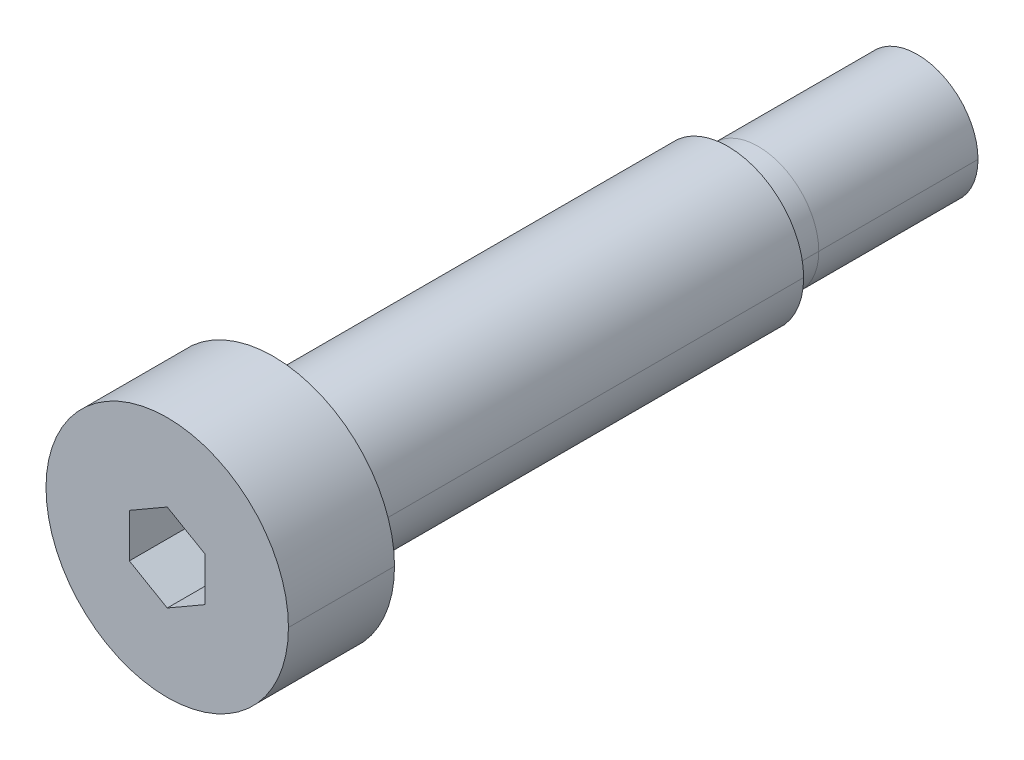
ISO-10303-21;
HEADER;
FILE_DESCRIPTION(('STEP AP214'),'2;1');
FILE_NAME('part.step','',(''),(''),'','','');
FILE_SCHEMA(('AUTOMOTIVE_DESIGN { 1 0 10303 214 1 1 1 1 }'));
ENDSEC;
DATA;
#1=APPLICATION_CONTEXT('core data for automotive mechanical design processes');
#2=APPLICATION_PROTOCOL_DEFINITION('international standard','automotive_design',2000,#1);
#3=PRODUCT_CONTEXT('',#1,'mechanical');
#4=PRODUCT('Part','Part','',(#3));
#5=PRODUCT_RELATED_PRODUCT_CATEGORY('part','',(#4));
#6=PRODUCT_DEFINITION_FORMATION('','',#4);
#7=PRODUCT_DEFINITION_CONTEXT('part definition',#1,'design');
#8=PRODUCT_DEFINITION('design','',#6,#7);
#9=PRODUCT_DEFINITION_SHAPE('','',#8);
#10=(LENGTH_UNIT() NAMED_UNIT(*) SI_UNIT(.MILLI.,.METRE.));
#11=(NAMED_UNIT(*) PLANE_ANGLE_UNIT() SI_UNIT($,.RADIAN.));
#12=(NAMED_UNIT(*) SI_UNIT($,.STERADIAN.) SOLID_ANGLE_UNIT());
#13=UNCERTAINTY_MEASURE_WITH_UNIT(LENGTH_MEASURE(1.E-05),#10,'distance_accuracy_value','');
#14=(GEOMETRIC_REPRESENTATION_CONTEXT(3) GLOBAL_UNCERTAINTY_ASSIGNED_CONTEXT((#13)) GLOBAL_UNIT_ASSIGNED_CONTEXT((#10,
#11,#12)) REPRESENTATION_CONTEXT('',''));
#15=CARTESIAN_POINT('',(0.,0.,0.));
#16=DIRECTION('',(0.,0.,1.));
#17=DIRECTION('',(1.,0.,0.));
#18=AXIS2_PLACEMENT_3D('',#15,#16,#17);
#19=CARTESIAN_POINT('',(0.,0.,-9.));
#20=DIRECTION('',(0.,0.,1.));
#21=DIRECTION('',(1.,0.,0.));
#22=AXIS2_PLACEMENT_3D('',#19,#20,#21);
#23=CYLINDRICAL_SURFACE('',#22,4.);
#24=CARTESIAN_POINT('',(0.,0.,-42.5063536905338));
#25=DIRECTION('',(0.,0.,1.));
#26=DIRECTION('',(1.,0.,0.));
#27=AXIS2_PLACEMENT_3D('',#24,#25,#26);
#28=CIRCLE('',#27,4.);
#29=CARTESIAN_POINT('',(4.,0.,-42.5063536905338));
#30=VERTEX_POINT('',#29);
#31=CARTESIAN_POINT('',(-4.,0.,-42.5063536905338));
#32=VERTEX_POINT('',#31);
#33=EDGE_CURVE('P0_E11',#30,#32,#28,.T.);
#34=ORIENTED_EDGE('',*,*,#33,.T.);
#35=DIRECTION('',(0.,0.,1.));
#36=VECTOR('',#35,1.);
#37=CARTESIAN_POINT('',(-4.,0.,-9.));
#38=LINE('',#37,#36);
#39=CARTESIAN_POINT('',(-4.,0.,-32.));
#40=VERTEX_POINT('',#39);
#41=EDGE_CURVE('P0_E28',#32,#40,#38,.T.);
#42=ORIENTED_EDGE('',*,*,#41,.T.);
#43=CARTESIAN_POINT('',(0.,0.,-32.));
#44=DIRECTION('',(0.,0.,1.));
#45=DIRECTION('',(1.,0.,0.));
#46=AXIS2_PLACEMENT_3D('',#43,#44,#45);
#47=CIRCLE('',#46,4.);
#48=CARTESIAN_POINT('',(4.,0.,-32.));
#49=VERTEX_POINT('',#48);
#50=EDGE_CURVE('P0_E98',#49,#40,#47,.T.);
#51=ORIENTED_EDGE('',*,*,#50,.F.);
#52=DIRECTION('',(0.,0.,1.));
#53=VECTOR('',#52,1.);
#54=CARTESIAN_POINT('',(4.,0.,-9.));
#55=LINE('',#54,#53);
#56=EDGE_CURVE('P0_E127',#30,#49,#55,.T.);
#57=ORIENTED_EDGE('',*,*,#56,.F.);
#58=EDGE_LOOP('',(#34,#42,#51,#57));
#59=FACE_BOUND('',#58,.T.);
#60=ADVANCED_FACE('P0_F17',(#59),#23,.T.);
#61=CARTESIAN_POINT('',(0.,0.,-9.));
#62=DIRECTION('',(0.,0.,1.));
#63=DIRECTION('',(1.,0.,0.));
#64=AXIS2_PLACEMENT_3D('',#61,#62,#63);
#65=CYLINDRICAL_SURFACE('',#64,3.295);
#66=CARTESIAN_POINT('',(0.,0.,-43.));
#67=DIRECTION('',(0.,0.,1.));
#68=DIRECTION('',(1.,0.,0.));
#69=AXIS2_PLACEMENT_3D('',#66,#67,#68);
#70=CIRCLE('',#69,3.295);
#71=CARTESIAN_POINT('',(-3.295,0.,-43.));
#72=VERTEX_POINT('',#71);
#73=CARTESIAN_POINT('',(3.295,0.,-43.));
#74=VERTEX_POINT('',#73);
#75=EDGE_CURVE('P0_E93',#72,#74,#70,.T.);
#76=ORIENTED_EDGE('',*,*,#75,.F.);
#77=DIRECTION('',(0.,0.,1.));
#78=VECTOR('',#77,1.);
#79=CARTESIAN_POINT('',(-3.295,0.,-9.));
#80=LINE('',#79,#78);
#81=CARTESIAN_POINT('',(-3.295,0.,-32.));
#82=VERTEX_POINT('',#81);
#83=EDGE_CURVE('P0_E88',#72,#82,#80,.T.);
#84=ORIENTED_EDGE('',*,*,#83,.T.);
#85=CARTESIAN_POINT('',(0.,0.,-32.));
#86=DIRECTION('',(0.,0.,1.));
#87=DIRECTION('',(1.,0.,0.));
#88=AXIS2_PLACEMENT_3D('',#85,#86,#87);
#89=CIRCLE('',#88,3.295);
#90=CARTESIAN_POINT('',(3.295,0.,-32.));
#91=VERTEX_POINT('',#90);
#92=EDGE_CURVE('P0_E84',#82,#91,#89,.T.);
#93=ORIENTED_EDGE('',*,*,#92,.T.);
#94=DIRECTION('',(0.,0.,1.));
#95=VECTOR('',#94,1.);
#96=CARTESIAN_POINT('',(3.295,0.,-9.));
#97=LINE('',#96,#95);
#98=EDGE_CURVE('P0_E70',#74,#91,#97,.T.);
#99=ORIENTED_EDGE('',*,*,#98,.F.);
#100=EDGE_LOOP('',(#76,#84,#93,#99));
#101=FACE_BOUND('',#100,.T.);
#102=ADVANCED_FACE('P0_F92',(#101),#65,.F.);
#103=CARTESIAN_POINT('',(0.,0.,-42.5063536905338));
#104=DIRECTION('',(0.,0.,1.));
#105=DIRECTION('',(1.,0.,0.));
#106=AXIS2_PLACEMENT_3D('',#103,#104,#105);
#107=CONICAL_SURFACE('',#106,4.,0.959931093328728);
#108=CARTESIAN_POINT('',(0.,0.,-43.));
#109=DIRECTION('',(0.,0.,1.));
#110=DIRECTION('',(1.,0.,0.));
#111=AXIS2_PLACEMENT_3D('',#108,#109,#110);
#112=CIRCLE('',#111,3.295);
#113=EDGE_CURVE('P0_E89',#74,#72,#112,.T.);
#114=ORIENTED_EDGE('',*,*,#113,.T.);
#115=DIRECTION('',(-0.819152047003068,0.,0.573576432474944));
#116=VECTOR('',#115,1.);
#117=CARTESIAN_POINT('',(-4.,0.,-42.5063536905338));
#118=LINE('',#117,#116);
#119=EDGE_CURVE('P0_E43',#72,#32,#118,.T.);
#120=ORIENTED_EDGE('',*,*,#119,.T.);
#121=ORIENTED_EDGE('',*,*,#33,.F.);
#122=DIRECTION('',(0.819152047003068,0.,0.573576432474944));
#123=VECTOR('',#122,1.);
#124=CARTESIAN_POINT('',(4.,0.,-42.5063536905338));
#125=LINE('',#124,#123);
#126=EDGE_CURVE('P0_E105',#74,#30,#125,.T.);
#127=ORIENTED_EDGE('',*,*,#126,.F.);
#128=EDGE_LOOP('',(#114,#120,#121,#127));
#129=FACE_BOUND('',#128,.T.);
#130=ADVANCED_FACE('P0_F143',(#129),#107,.T.);
#131=CARTESIAN_POINT('',(0.,0.,-42.5063536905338));
#132=DIRECTION('',(0.,0.,1.));
#133=DIRECTION('',(1.,0.,0.));
#134=AXIS2_PLACEMENT_3D('',#131,#132,#133);
#135=CONICAL_SURFACE('',#134,4.,0.959931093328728);
#136=ORIENTED_EDGE('',*,*,#119,.F.);
#137=ORIENTED_EDGE('',*,*,#75,.T.);
#138=ORIENTED_EDGE('',*,*,#126,.T.);
#139=CARTESIAN_POINT('',(0.,0.,-42.5063536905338));
#140=DIRECTION('',(0.,0.,1.));
#141=DIRECTION('',(1.,0.,0.));
#142=AXIS2_PLACEMENT_3D('',#139,#140,#141);
#143=CIRCLE('',#142,4.);
#144=EDGE_CURVE('P0_E21',#32,#30,#143,.T.);
#145=ORIENTED_EDGE('',*,*,#144,.F.);
#146=EDGE_LOOP('',(#136,#137,#138,#145));
#147=FACE_BOUND('',#146,.T.);
#148=ADVANCED_FACE('P0_F141',(#147),#135,.T.);
#149=CARTESIAN_POINT('',(0.,0.,-9.));
#150=DIRECTION('',(0.,0.,1.));
#151=DIRECTION('',(1.,0.,0.));
#152=AXIS2_PLACEMENT_3D('',#149,#150,#151);
#153=CYLINDRICAL_SURFACE('',#152,3.295);
#154=ORIENTED_EDGE('',*,*,#83,.F.);
#155=ORIENTED_EDGE('',*,*,#113,.F.);
#156=ORIENTED_EDGE('',*,*,#98,.T.);
#157=CARTESIAN_POINT('',(0.,0.,-32.));
#158=DIRECTION('',(0.,0.,1.));
#159=DIRECTION('',(1.,0.,0.));
#160=AXIS2_PLACEMENT_3D('',#157,#158,#159);
#161=CIRCLE('',#160,3.295);
#162=EDGE_CURVE('P0_E86',#91,#82,#161,.T.);
#163=ORIENTED_EDGE('',*,*,#162,.T.);
#164=EDGE_LOOP('',(#154,#155,#156,#163));
#165=FACE_BOUND('',#164,.T.);
#166=ADVANCED_FACE('P0_F96',(#165),#153,.F.);
#167=CARTESIAN_POINT('',(0.,3.295,-32.));
#168=DIRECTION('',(0.,0.,1.));
#169=DIRECTION('',(1.,0.,0.));
#170=AXIS2_PLACEMENT_3D('',#167,#168,#169);
#171=PLANE('',#170);
#172=ORIENTED_EDGE('',*,*,#50,.T.);
#173=CARTESIAN_POINT('',(0.,0.,-32.));
#174=DIRECTION('',(0.,0.,1.));
#175=DIRECTION('',(1.,0.,0.));
#176=AXIS2_PLACEMENT_3D('',#173,#174,#175);
#177=CIRCLE('',#176,4.);
#178=EDGE_CURVE('P0_E107',#40,#49,#177,.T.);
#179=ORIENTED_EDGE('',*,*,#178,.T.);
#180=EDGE_LOOP('',(#172,#179));
#181=FACE_BOUND('',#180,.T.);
#182=ORIENTED_EDGE('',*,*,#162,.F.);
#183=ORIENTED_EDGE('',*,*,#92,.F.);
#184=EDGE_LOOP('',(#182,#183));
#185=FACE_BOUND('',#184,.T.);
#186=ADVANCED_FACE('P0_F19',(#181,#185),#171,.T.);
#187=CARTESIAN_POINT('',(0.,0.,-9.));
#188=DIRECTION('',(0.,0.,1.));
#189=DIRECTION('',(1.,0.,0.));
#190=AXIS2_PLACEMENT_3D('',#187,#188,#189);
#191=CYLINDRICAL_SURFACE('',#190,4.);
#192=ORIENTED_EDGE('',*,*,#41,.F.);
#193=ORIENTED_EDGE('',*,*,#144,.T.);
#194=ORIENTED_EDGE('',*,*,#56,.T.);
#195=ORIENTED_EDGE('',*,*,#178,.F.);
#196=EDGE_LOOP('',(#192,#193,#194,#195));
#197=FACE_BOUND('',#196,.T.);
#198=ADVANCED_FACE('P0_F139',(#197),#191,.T.);
#199=CLOSED_SHELL('',(#60,#102,#130,#148,#166,#186,#198));
#200=MANIFOLD_SOLID_BREP('P0_B1',#199);
#201=CARTESIAN_POINT('',(0.,0.,-43.));
#202=DIRECTION('',(0.,0.,-1.));
#203=DIRECTION('',(-1.,0.,0.));
#204=AXIS2_PLACEMENT_3D('',#201,#202,#203);
#205=CYLINDRICAL_SURFACE('',#204,3.295);
#206=CARTESIAN_POINT('',(0.,0.,-32.));
#207=DIRECTION('',(0.,0.,-1.));
#208=DIRECTION('',(-1.,0.,0.));
#209=AXIS2_PLACEMENT_3D('',#206,#207,#208);
#210=CIRCLE('',#209,3.295);
#211=CARTESIAN_POINT('',(-3.295,0.,-32.));
#212=VERTEX_POINT('',#211);
#213=CARTESIAN_POINT('',(3.295,0.,-32.));
#214=VERTEX_POINT('',#213);
#215=EDGE_CURVE('P1_E11',#212,#214,#210,.T.);
#216=ORIENTED_EDGE('',*,*,#215,.T.);
#217=DIRECTION('',(0.,0.,-1.));
#218=VECTOR('',#217,1.);
#219=CARTESIAN_POINT('',(3.295,0.,-43.));
#220=LINE('',#219,#218);
#221=CARTESIAN_POINT('',(3.295,0.,-43.));
#222=VERTEX_POINT('',#221);
#223=EDGE_CURVE('P1_E28',#214,#222,#220,.T.);
#224=ORIENTED_EDGE('',*,*,#223,.T.);
#225=CARTESIAN_POINT('',(0.,0.,-43.));
#226=DIRECTION('',(0.,0.,-1.));
#227=DIRECTION('',(-1.,0.,0.));
#228=AXIS2_PLACEMENT_3D('',#225,#226,#227);
#229=CIRCLE('',#228,3.295);
#230=CARTESIAN_POINT('',(-3.295,0.,-43.));
#231=VERTEX_POINT('',#230);
#232=EDGE_CURVE('P1_E271',#231,#222,#229,.T.);
#233=ORIENTED_EDGE('',*,*,#232,.F.);
#234=DIRECTION('',(0.,0.,-1.));
#235=VECTOR('',#234,1.);
#236=CARTESIAN_POINT('',(-3.295,0.,-43.));
#237=LINE('',#236,#235);
#238=EDGE_CURVE('P1_E295',#212,#231,#237,.T.);
#239=ORIENTED_EDGE('',*,*,#238,.F.);
#240=EDGE_LOOP('',(#216,#224,#233,#239));
#241=FACE_BOUND('',#240,.T.);
#242=ADVANCED_FACE('P1_F17',(#241),#205,.T.);
#243=CARTESIAN_POINT('',(0.,0.,-43.));
#244=DIRECTION('',(0.,0.,-1.));
#245=DIRECTION('',(-1.,0.,0.));
#246=AXIS2_PLACEMENT_3D('',#243,#244,#245);
#247=CYLINDRICAL_SURFACE('',#246,8.);
#248=CARTESIAN_POINT('',(0.,0.,7.));
#249=DIRECTION('',(0.,0.,-1.));
#250=DIRECTION('',(-1.,0.,0.));
#251=AXIS2_PLACEMENT_3D('',#248,#249,#250);
#252=CIRCLE('',#251,8.);
#253=CARTESIAN_POINT('',(-8.,0.,7.));
#254=VERTEX_POINT('',#253);
#255=CARTESIAN_POINT('',(8.,0.,7.));
#256=VERTEX_POINT('',#255);
#257=EDGE_CURVE('P1_E220',#254,#256,#252,.T.);
#258=ORIENTED_EDGE('',*,*,#257,.T.);
#259=DIRECTION('',(0.,0.,-1.));
#260=VECTOR('',#259,1.);
#261=CARTESIAN_POINT('',(8.,0.,-43.));
#262=LINE('',#261,#260);
#263=CARTESIAN_POINT('',(8.,0.,0.));
#264=VERTEX_POINT('',#263);
#265=EDGE_CURVE('P1_E21',#256,#264,#262,.T.);
#266=ORIENTED_EDGE('',*,*,#265,.T.);
#267=CARTESIAN_POINT('',(0.,0.,0.));
#268=DIRECTION('',(0.,0.,-1.));
#269=DIRECTION('',(-1.,0.,0.));
#270=AXIS2_PLACEMENT_3D('',#267,#268,#269);
#271=CIRCLE('',#270,8.);
#272=CARTESIAN_POINT('',(-8.,0.,0.));
#273=VERTEX_POINT('',#272);
#274=EDGE_CURVE('P1_E234',#273,#264,#271,.T.);
#275=ORIENTED_EDGE('',*,*,#274,.F.);
#276=DIRECTION('',(0.,0.,-1.));
#277=VECTOR('',#276,1.);
#278=CARTESIAN_POINT('',(-8.,0.,-43.));
#279=LINE('',#278,#277);
#280=EDGE_CURVE('P1_E270',#254,#273,#279,.T.);
#281=ORIENTED_EDGE('',*,*,#280,.F.);
#282=EDGE_LOOP('',(#258,#266,#275,#281));
#283=FACE_BOUND('',#282,.T.);
#284=ADVANCED_FACE('P1_F319',(#283),#247,.T.);
#285=CARTESIAN_POINT('',(0.,0.,-43.));
#286=DIRECTION('',(0.,0.,-1.));
#287=DIRECTION('',(-1.,0.,0.));
#288=AXIS2_PLACEMENT_3D('',#285,#286,#287);
#289=CYLINDRICAL_SURFACE('',#288,5.);
#290=CARTESIAN_POINT('',(0.,0.,0.));
#291=DIRECTION('',(0.,0.,-1.));
#292=DIRECTION('',(-1.,0.,0.));
#293=AXIS2_PLACEMENT_3D('',#290,#291,#292);
#294=CIRCLE('',#293,5.);
#295=CARTESIAN_POINT('',(-5.,0.,0.));
#296=VERTEX_POINT('',#295);
#297=CARTESIAN_POINT('',(5.,0.,0.));
#298=VERTEX_POINT('',#297);
#299=EDGE_CURVE('P1_E224',#296,#298,#294,.T.);
#300=ORIENTED_EDGE('',*,*,#299,.T.);
#301=DIRECTION('',(0.,0.,-1.));
#302=VECTOR('',#301,1.);
#303=CARTESIAN_POINT('',(5.,0.,-43.));
#304=LINE('',#303,#302);
#305=CARTESIAN_POINT('',(5.,0.,-30.));
#306=VERTEX_POINT('',#305);
#307=EDGE_CURVE('P1_E227',#298,#306,#304,.T.);
#308=ORIENTED_EDGE('',*,*,#307,.T.);
#309=CARTESIAN_POINT('',(0.,0.,-30.));
#310=DIRECTION('',(0.,0.,-1.));
#311=DIRECTION('',(-1.,0.,0.));
#312=AXIS2_PLACEMENT_3D('',#309,#310,#311);
#313=CIRCLE('',#312,5.);
#314=CARTESIAN_POINT('',(-5.,0.,-30.));
#315=VERTEX_POINT('',#314);
#316=EDGE_CURVE('P1_E219',#315,#306,#313,.T.);
#317=ORIENTED_EDGE('',*,*,#316,.F.);
#318=DIRECTION('',(0.,0.,-1.));
#319=VECTOR('',#318,1.);
#320=CARTESIAN_POINT('',(-5.,0.,-43.));
#321=LINE('',#320,#319);
#322=EDGE_CURVE('P1_E83',#296,#315,#321,.T.);
#323=ORIENTED_EDGE('',*,*,#322,.F.);
#324=EDGE_LOOP('',(#300,#308,#317,#323));
#325=FACE_BOUND('',#324,.T.);
#326=ADVANCED_FACE('P1_F382',(#325),#289,.T.);
#327=CARTESIAN_POINT('',(0.,0.,-43.));
#328=DIRECTION('',(0.,0.,-1.));
#329=DIRECTION('',(-1.,0.,0.));
#330=AXIS2_PLACEMENT_3D('',#327,#328,#329);
#331=CYLINDRICAL_SURFACE('',#330,4.);
#332=CARTESIAN_POINT('',(0.,0.,-30.));
#333=DIRECTION('',(0.,0.,-1.));
#334=DIRECTION('',(-1.,0.,0.));
#335=AXIS2_PLACEMENT_3D('',#332,#333,#334);
#336=CIRCLE('',#335,4.);
#337=CARTESIAN_POINT('',(-4.,0.,-30.));
#338=VERTEX_POINT('',#337);
#339=CARTESIAN_POINT('',(4.,0.,-30.));
#340=VERTEX_POINT('',#339);
#341=EDGE_CURVE('P1_E253',#338,#340,#336,.T.);
#342=ORIENTED_EDGE('',*,*,#341,.T.);
#343=DIRECTION('',(0.,0.,-1.));
#344=VECTOR('',#343,1.);
#345=CARTESIAN_POINT('',(4.,0.,-43.));
#346=LINE('',#345,#344);
#347=CARTESIAN_POINT('',(4.,0.,-32.));
#348=VERTEX_POINT('',#347);
#349=EDGE_CURVE('P1_E98',#340,#348,#346,.T.);
#350=ORIENTED_EDGE('',*,*,#349,.T.);
#351=CARTESIAN_POINT('',(0.,0.,-32.));
#352=DIRECTION('',(0.,0.,-1.));
#353=DIRECTION('',(-1.,0.,0.));
#354=AXIS2_PLACEMENT_3D('',#351,#352,#353);
#355=CIRCLE('',#354,4.);
#356=CARTESIAN_POINT('',(-4.,0.,-32.));
#357=VERTEX_POINT('',#356);
#358=EDGE_CURVE('P1_E254',#357,#348,#355,.T.);
#359=ORIENTED_EDGE('',*,*,#358,.F.);
#360=DIRECTION('',(0.,0.,-1.));
#361=VECTOR('',#360,1.);
#362=CARTESIAN_POINT('',(-4.,0.,-43.));
#363=LINE('',#362,#361);
#364=EDGE_CURVE('P1_E237',#338,#357,#363,.T.);
#365=ORIENTED_EDGE('',*,*,#364,.F.);
#366=EDGE_LOOP('',(#342,#350,#359,#365));
#367=FACE_BOUND('',#366,.T.);
#368=ADVANCED_FACE('P1_F389',(#367),#331,.T.);
#369=CARTESIAN_POINT('',(0.,0.,7.));
#370=DIRECTION('',(0.,0.,-1.));
#371=DIRECTION('',(0.,-1.,0.));
#372=AXIS2_PLACEMENT_3D('',#369,#370,#371);
#373=PLANE('',#372);
#374=ORIENTED_EDGE('',*,*,#257,.F.);
#375=CARTESIAN_POINT('',(0.,0.,7.));
#376=DIRECTION('',(0.,0.,-1.));
#377=DIRECTION('',(-1.,0.,0.));
#378=AXIS2_PLACEMENT_3D('',#375,#376,#377);
#379=CIRCLE('',#378,8.);
#380=EDGE_CURVE('P1_E235',#256,#254,#379,.T.);
#381=ORIENTED_EDGE('',*,*,#380,.F.);
#382=EDGE_LOOP('',(#374,#381));
#383=FACE_BOUND('',#382,.T.);
#384=DIRECTION('',(-0.866025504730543,-0.499999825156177,0.));
#385=VECTOR('',#384,1.);
#386=CARTESIAN_POINT('',(-1.24999912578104,2.16506300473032,7.));
#387=LINE('',#386,#385);
#388=CARTESIAN_POINT('',(0.,2.88675,7.));
#389=VERTEX_POINT('',#388);
#390=CARTESIAN_POINT('',(-2.5,1.443375,7.));
#391=VERTEX_POINT('',#390);
#392=EDGE_CURVE('P1_E260',#389,#391,#387,.T.);
#393=ORIENTED_EDGE('',*,*,#392,.F.);
#394=DIRECTION('',(-0.866025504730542,0.499999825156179,0.));
#395=VECTOR('',#394,1.);
#396=CARTESIAN_POINT('',(1.24999912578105,2.16506300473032,7.));
#397=LINE('',#396,#395);
#398=CARTESIAN_POINT('',(2.5,1.443375,7.));
#399=VERTEX_POINT('',#398);
#400=EDGE_CURVE('P1_E202',#399,#389,#397,.T.);
#401=ORIENTED_EDGE('',*,*,#400,.F.);
#402=DIRECTION('',(0.,1.,0.));
#403=VECTOR('',#402,1.);
#404=CARTESIAN_POINT('',(2.5,0.,7.));
#405=LINE('',#404,#403);
#406=CARTESIAN_POINT('',(2.5,-1.443375,7.));
#407=VERTEX_POINT('',#406);
#408=EDGE_CURVE('P1_E188',#407,#399,#405,.T.);
#409=ORIENTED_EDGE('',*,*,#408,.F.);
#410=DIRECTION('',(0.866025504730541,0.499999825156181,0.));
#411=VECTOR('',#410,1.);
#412=CARTESIAN_POINT('',(1.24999912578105,-2.16506300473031,7.));
#413=LINE('',#412,#411);
#414=CARTESIAN_POINT('',(0.,-2.88675,7.));
#415=VERTEX_POINT('',#414);
#416=EDGE_CURVE('P1_E215',#415,#407,#413,.T.);
#417=ORIENTED_EDGE('',*,*,#416,.F.);
#418=DIRECTION('',(0.866025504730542,-0.499999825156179,0.));
#419=VECTOR('',#418,1.);
#420=CARTESIAN_POINT('',(-1.24999912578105,-2.16506300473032,7.));
#421=LINE('',#420,#419);
#422=CARTESIAN_POINT('',(-2.4999982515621,-1.44337600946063,7.));
#423=VERTEX_POINT('',#422);
#424=EDGE_CURVE('P1_E282',#423,#415,#421,.T.);
#425=ORIENTED_EDGE('',*,*,#424,.F.);
#426=DIRECTION('',(6.0567672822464E-07,-0.999999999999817,0.));
#427=VECTOR('',#426,1.);
#428=CARTESIAN_POINT('',(-2.49999912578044,-1.51419129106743E-06,7.));
#429=LINE('',#428,#427);
#430=EDGE_CURVE('P1_E249',#391,#423,#429,.T.);
#431=ORIENTED_EDGE('',*,*,#430,.F.);
#432=EDGE_LOOP('',(#393,#401,#409,#417,#425,#431));
#433=FACE_BOUND('',#432,.T.);
#434=ADVANCED_FACE('P1_F290',(#383,#433),#373,.F.);
#435=CARTESIAN_POINT('',(4.,0.,-32.));
#436=DIRECTION('',(0.,0.,1.));
#437=DIRECTION('',(1.,0.,0.));
#438=AXIS2_PLACEMENT_3D('',#435,#436,#437);
#439=PLANE('',#438);
#440=ORIENTED_EDGE('',*,*,#358,.T.);
#441=CARTESIAN_POINT('',(0.,0.,-32.));
#442=DIRECTION('',(0.,0.,-1.));
#443=DIRECTION('',(-1.,0.,0.));
#444=AXIS2_PLACEMENT_3D('',#441,#442,#443);
#445=CIRCLE('',#444,4.);
#446=EDGE_CURVE('P1_E263',#348,#357,#445,.T.);
#447=ORIENTED_EDGE('',*,*,#446,.T.);
#448=EDGE_LOOP('',(#440,#447));
#449=FACE_BOUND('',#448,.T.);
#450=ORIENTED_EDGE('',*,*,#215,.F.);
#451=CARTESIAN_POINT('',(0.,0.,-32.));
#452=DIRECTION('',(0.,0.,-1.));
#453=DIRECTION('',(-1.,0.,0.));
#454=AXIS2_PLACEMENT_3D('',#451,#452,#453);
#455=CIRCLE('',#454,3.295);
#456=EDGE_CURVE('P1_E344',#214,#212,#455,.T.);
#457=ORIENTED_EDGE('',*,*,#456,.F.);
#458=EDGE_LOOP('',(#450,#457));
#459=FACE_BOUND('',#458,.T.);
#460=ADVANCED_FACE('P1_F361',(#449,#459),#439,.F.);
#461=CARTESIAN_POINT('',(0.,0.,-43.));
#462=DIRECTION('',(0.,0.,-1.));
#463=DIRECTION('',(-1.,0.,0.));
#464=AXIS2_PLACEMENT_3D('',#461,#462,#463);
#465=CYLINDRICAL_SURFACE('',#464,4.);
#466=ORIENTED_EDGE('',*,*,#349,.F.);
#467=CARTESIAN_POINT('',(0.,0.,-30.));
#468=DIRECTION('',(0.,0.,-1.));
#469=DIRECTION('',(-1.,0.,0.));
#470=AXIS2_PLACEMENT_3D('',#467,#468,#469);
#471=CIRCLE('',#470,4.);
#472=EDGE_CURVE('P1_E240',#340,#338,#471,.T.);
#473=ORIENTED_EDGE('',*,*,#472,.T.);
#474=ORIENTED_EDGE('',*,*,#364,.T.);
#475=ORIENTED_EDGE('',*,*,#446,.F.);
#476=EDGE_LOOP('',(#466,#473,#474,#475));
#477=FACE_BOUND('',#476,.T.);
#478=ADVANCED_FACE('P1_F393',(#477),#465,.T.);
#479=CARTESIAN_POINT('',(5.,0.,-30.));
#480=DIRECTION('',(0.,0.,1.));
#481=DIRECTION('',(1.,0.,0.));
#482=AXIS2_PLACEMENT_3D('',#479,#480,#481);
#483=PLANE('',#482);
#484=ORIENTED_EDGE('',*,*,#316,.T.);
#485=CARTESIAN_POINT('',(0.,0.,-30.));
#486=DIRECTION('',(0.,0.,-1.));
#487=DIRECTION('',(-1.,0.,0.));
#488=AXIS2_PLACEMENT_3D('',#485,#486,#487);
#489=CIRCLE('',#488,5.);
#490=EDGE_CURVE('P1_E241',#306,#315,#489,.T.);
#491=ORIENTED_EDGE('',*,*,#490,.T.);
#492=EDGE_LOOP('',(#484,#491));
#493=FACE_BOUND('',#492,.T.);
#494=ORIENTED_EDGE('',*,*,#341,.F.);
#495=ORIENTED_EDGE('',*,*,#472,.F.);
#496=EDGE_LOOP('',(#494,#495));
#497=FACE_BOUND('',#496,.T.);
#498=ADVANCED_FACE('P1_F391',(#493,#497),#483,.F.);
#499=CARTESIAN_POINT('',(0.,0.,-43.));
#500=DIRECTION('',(0.,0.,-1.));
#501=DIRECTION('',(-1.,0.,0.));
#502=AXIS2_PLACEMENT_3D('',#499,#500,#501);
#503=CYLINDRICAL_SURFACE('',#502,5.);
#504=ORIENTED_EDGE('',*,*,#307,.F.);
#505=CARTESIAN_POINT('',(0.,0.,0.));
#506=DIRECTION('',(0.,0.,-1.));
#507=DIRECTION('',(-1.,0.,0.));
#508=AXIS2_PLACEMENT_3D('',#505,#506,#507);
#509=CIRCLE('',#508,5.);
#510=EDGE_CURVE('P1_E245',#298,#296,#509,.T.);
#511=ORIENTED_EDGE('',*,*,#510,.T.);
#512=ORIENTED_EDGE('',*,*,#322,.T.);
#513=ORIENTED_EDGE('',*,*,#490,.F.);
#514=EDGE_LOOP('',(#504,#511,#512,#513));
#515=FACE_BOUND('',#514,.T.);
#516=ADVANCED_FACE('P1_F326',(#515),#503,.T.);
#517=CARTESIAN_POINT('',(8.,0.,0.));
#518=DIRECTION('',(0.,0.,1.));
#519=DIRECTION('',(1.,0.,0.));
#520=AXIS2_PLACEMENT_3D('',#517,#518,#519);
#521=PLANE('',#520);
#522=ORIENTED_EDGE('',*,*,#274,.T.);
#523=CARTESIAN_POINT('',(0.,0.,0.));
#524=DIRECTION('',(0.,0.,-1.));
#525=DIRECTION('',(-1.,0.,0.));
#526=AXIS2_PLACEMENT_3D('',#523,#524,#525);
#527=CIRCLE('',#526,8.);
#528=EDGE_CURVE('P1_E231',#264,#273,#527,.T.);
#529=ORIENTED_EDGE('',*,*,#528,.T.);
#530=EDGE_LOOP('',(#522,#529));
#531=FACE_BOUND('',#530,.T.);
#532=ORIENTED_EDGE('',*,*,#299,.F.);
#533=ORIENTED_EDGE('',*,*,#510,.F.);
#534=EDGE_LOOP('',(#532,#533));
#535=FACE_BOUND('',#534,.T.);
#536=ADVANCED_FACE('P1_F323',(#531,#535),#521,.F.);
#537=CARTESIAN_POINT('',(0.,0.,-43.));
#538=DIRECTION('',(0.,0.,-1.));
#539=DIRECTION('',(-1.,0.,0.));
#540=AXIS2_PLACEMENT_3D('',#537,#538,#539);
#541=CYLINDRICAL_SURFACE('',#540,8.);
#542=ORIENTED_EDGE('',*,*,#265,.F.);
#543=ORIENTED_EDGE('',*,*,#380,.T.);
#544=ORIENTED_EDGE('',*,*,#280,.T.);
#545=ORIENTED_EDGE('',*,*,#528,.F.);
#546=EDGE_LOOP('',(#542,#543,#544,#545));
#547=FACE_BOUND('',#546,.T.);
#548=ADVANCED_FACE('P1_F314',(#547),#541,.T.);
#549=CARTESIAN_POINT('',(3.295,0.,-43.));
#550=DIRECTION('',(0.,0.,1.));
#551=DIRECTION('',(1.,0.,0.));
#552=AXIS2_PLACEMENT_3D('',#549,#550,#551);
#553=PLANE('',#552);
#554=ORIENTED_EDGE('',*,*,#232,.T.);
#555=CARTESIAN_POINT('',(0.,0.,-43.));
#556=DIRECTION('',(0.,0.,-1.));
#557=DIRECTION('',(-1.,0.,0.));
#558=AXIS2_PLACEMENT_3D('',#555,#556,#557);
#559=CIRCLE('',#558,3.295);
#560=EDGE_CURVE('P1_E274',#222,#231,#559,.T.);
#561=ORIENTED_EDGE('',*,*,#560,.T.);
#562=EDGE_LOOP('',(#554,#561));
#563=FACE_BOUND('',#562,.T.);
#564=ADVANCED_FACE('P1_F364',(#563),#553,.F.);
#565=CARTESIAN_POINT('',(0.,0.,-43.));
#566=DIRECTION('',(0.,0.,-1.));
#567=DIRECTION('',(-1.,0.,0.));
#568=AXIS2_PLACEMENT_3D('',#565,#566,#567);
#569=CYLINDRICAL_SURFACE('',#568,3.295);
#570=ORIENTED_EDGE('',*,*,#223,.F.);
#571=ORIENTED_EDGE('',*,*,#456,.T.);
#572=ORIENTED_EDGE('',*,*,#238,.T.);
#573=ORIENTED_EDGE('',*,*,#560,.F.);
#574=EDGE_LOOP('',(#570,#571,#572,#573));
#575=FACE_BOUND('',#574,.T.);
#576=ADVANCED_FACE('P1_F357',(#575),#569,.T.);
#577=CARTESIAN_POINT('',(-2.5,1.443375,2.99999999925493));
#578=DIRECTION('',(0.499999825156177,-0.866025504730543,0.));
#579=DIRECTION('',(0.,0.,-1.));
#580=AXIS2_PLACEMENT_3D('',#577,#578,#579);
#581=PLANE('',#580);
#582=ORIENTED_EDGE('',*,*,#392,.T.);
#583=DIRECTION('',(0.,0.,1.));
#584=VECTOR('',#583,1.);
#585=CARTESIAN_POINT('',(-2.5,1.443375,2.99999999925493));
#586=LINE('',#585,#584);
#587=CARTESIAN_POINT('',(-2.5,1.443375,2.99999999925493));
#588=VERTEX_POINT('',#587);
#589=EDGE_CURVE('P1_E250',#588,#391,#586,.T.);
#590=ORIENTED_EDGE('',*,*,#589,.F.);
#591=DIRECTION('',(0.866025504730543,0.499999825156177,0.));
#592=VECTOR('',#591,1.);
#593=CARTESIAN_POINT('',(-2.5,1.443375,2.99999999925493));
#594=LINE('',#593,#592);
#595=CARTESIAN_POINT('',(0.,2.88675,2.99999999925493));
#596=VERTEX_POINT('',#595);
#597=EDGE_CURVE('P1_E230',#588,#596,#594,.T.);
#598=ORIENTED_EDGE('',*,*,#597,.T.);
#599=DIRECTION('',(0.,0.,1.));
#600=VECTOR('',#599,1.);
#601=CARTESIAN_POINT('',(0.,2.88675,2.99999999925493));
#602=LINE('',#601,#600);
#603=EDGE_CURVE('P1_E197',#596,#389,#602,.T.);
#604=ORIENTED_EDGE('',*,*,#603,.T.);
#605=EDGE_LOOP('',(#582,#590,#598,#604));
#606=FACE_BOUND('',#605,.T.);
#607=ADVANCED_FACE('P1_F297',(#606),#581,.T.);
#608=CARTESIAN_POINT('',(0.,2.88675,2.99999999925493));
#609=DIRECTION('',(-0.499999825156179,-0.866025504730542,0.));
#610=DIRECTION('',(-0.866025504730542,0.499999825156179,0.));
#611=AXIS2_PLACEMENT_3D('',#608,#609,#610);
#612=PLANE('',#611);
#613=ORIENTED_EDGE('',*,*,#400,.T.);
#614=ORIENTED_EDGE('',*,*,#603,.F.);
#615=DIRECTION('',(0.866025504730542,-0.499999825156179,0.));
#616=VECTOR('',#615,1.);
#617=CARTESIAN_POINT('',(0.,2.88675,2.99999999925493));
#618=LINE('',#617,#616);
#619=CARTESIAN_POINT('',(2.5,1.443375,2.99999999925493));
#620=VERTEX_POINT('',#619);
#621=EDGE_CURVE('P1_E192',#596,#620,#618,.T.);
#622=ORIENTED_EDGE('',*,*,#621,.T.);
#623=DIRECTION('',(0.,0.,1.));
#624=VECTOR('',#623,1.);
#625=CARTESIAN_POINT('',(2.5,1.443375,2.99999999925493));
#626=LINE('',#625,#624);
#627=EDGE_CURVE('P1_E182',#620,#399,#626,.T.);
#628=ORIENTED_EDGE('',*,*,#627,.T.);
#629=EDGE_LOOP('',(#613,#614,#622,#628));
#630=FACE_BOUND('',#629,.T.);
#631=ADVANCED_FACE('P1_F195',(#630),#612,.T.);
#632=CARTESIAN_POINT('',(2.5,1.443375,2.99999999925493));
#633=DIRECTION('',(-1.,0.,0.));
#634=DIRECTION('',(0.,0.,1.));
#635=AXIS2_PLACEMENT_3D('',#632,#633,#634);
#636=PLANE('',#635);
#637=ORIENTED_EDGE('',*,*,#408,.T.);
#638=ORIENTED_EDGE('',*,*,#627,.F.);
#639=DIRECTION('',(0.,-1.,0.));
#640=VECTOR('',#639,1.);
#641=CARTESIAN_POINT('',(2.5,1.443375,2.99999999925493));
#642=LINE('',#641,#640);
#643=CARTESIAN_POINT('',(2.5,-1.443375,2.99999999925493));
#644=VERTEX_POINT('',#643);
#645=EDGE_CURVE('P1_E185',#620,#644,#642,.T.);
#646=ORIENTED_EDGE('',*,*,#645,.T.);
#647=DIRECTION('',(0.,0.,1.));
#648=VECTOR('',#647,1.);
#649=CARTESIAN_POINT('',(2.5,-1.443375,2.99999999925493));
#650=LINE('',#649,#648);
#651=EDGE_CURVE('P1_E172',#644,#407,#650,.T.);
#652=ORIENTED_EDGE('',*,*,#651,.T.);
#653=EDGE_LOOP('',(#637,#638,#646,#652));
#654=FACE_BOUND('',#653,.T.);
#655=ADVANCED_FACE('P1_F19',(#654),#636,.T.);
#656=CARTESIAN_POINT('',(2.5,-1.443375,2.99999999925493));
#657=DIRECTION('',(-0.499999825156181,0.866025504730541,0.));
#658=DIRECTION('',(0.,0.,1.));
#659=AXIS2_PLACEMENT_3D('',#656,#657,#658);
#660=PLANE('',#659);
#661=ORIENTED_EDGE('',*,*,#416,.T.);
#662=ORIENTED_EDGE('',*,*,#651,.F.);
#663=DIRECTION('',(-0.866025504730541,-0.499999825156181,0.));
#664=VECTOR('',#663,1.);
#665=CARTESIAN_POINT('',(2.5,-1.443375,2.99999999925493));
#666=LINE('',#665,#664);
#667=CARTESIAN_POINT('',(0.,-2.88675,2.99999999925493));
#668=VERTEX_POINT('',#667);
#669=EDGE_CURVE('P1_E206',#644,#668,#666,.T.);
#670=ORIENTED_EDGE('',*,*,#669,.T.);
#671=DIRECTION('',(0.,0.,1.));
#672=VECTOR('',#671,1.);
#673=CARTESIAN_POINT('',(0.,-2.88675,2.99999999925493));
#674=LINE('',#673,#672);
#675=EDGE_CURVE('P1_E165',#668,#415,#674,.T.);
#676=ORIENTED_EDGE('',*,*,#675,.T.);
#677=EDGE_LOOP('',(#661,#662,#670,#676));
#678=FACE_BOUND('',#677,.T.);
#679=ADVANCED_FACE('P1_F386',(#678),#660,.T.);
#680=CARTESIAN_POINT('',(0.,-2.88675,2.99999999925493));
#681=DIRECTION('',(0.499999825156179,0.866025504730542,0.));
#682=DIRECTION('',(0.,0.,-1.));
#683=AXIS2_PLACEMENT_3D('',#680,#681,#682);
#684=PLANE('',#683);
#685=ORIENTED_EDGE('',*,*,#424,.T.);
#686=ORIENTED_EDGE('',*,*,#675,.F.);
#687=DIRECTION('',(-0.866025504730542,0.499999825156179,0.));
#688=VECTOR('',#687,1.);
#689=CARTESIAN_POINT('',(0.,-2.88675,2.99999999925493));
#690=LINE('',#689,#688);
#691=CARTESIAN_POINT('',(-2.4999982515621,-1.44337600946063,2.99999999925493));
#692=VERTEX_POINT('',#691);
#693=EDGE_CURVE('P1_E257',#668,#692,#690,.T.);
#694=ORIENTED_EDGE('',*,*,#693,.T.);
#695=DIRECTION('',(0.,0.,1.));
#696=VECTOR('',#695,1.);
#697=CARTESIAN_POINT('',(-2.4999982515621,-1.44337600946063,2.99999999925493));
#698=LINE('',#697,#696);
#699=EDGE_CURVE('P1_E156',#692,#423,#698,.T.);
#700=ORIENTED_EDGE('',*,*,#699,.T.);
#701=EDGE_LOOP('',(#685,#686,#694,#700));
#702=FACE_BOUND('',#701,.T.);
#703=ADVANCED_FACE('P1_F423',(#702),#684,.T.);
#704=CARTESIAN_POINT('',(-2.4999982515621,-1.44337600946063,2.99999999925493));
#705=DIRECTION('',(0.999999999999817,6.0567672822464E-07,0.));
#706=DIRECTION('',(0.,0.,-1.));
#707=AXIS2_PLACEMENT_3D('',#704,#705,#706);
#708=PLANE('',#707);
#709=ORIENTED_EDGE('',*,*,#430,.T.);
#710=ORIENTED_EDGE('',*,*,#699,.F.);
#711=DIRECTION('',(-6.0567672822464E-07,0.999999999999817,0.));
#712=VECTOR('',#711,1.);
#713=CARTESIAN_POINT('',(-2.4999982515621,-1.44337600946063,2.99999999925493));
#714=LINE('',#713,#712);
#715=EDGE_CURVE('P1_E246',#692,#588,#714,.T.);
#716=ORIENTED_EDGE('',*,*,#715,.T.);
#717=ORIENTED_EDGE('',*,*,#589,.T.);
#718=EDGE_LOOP('',(#709,#710,#716,#717));
#719=FACE_BOUND('',#718,.T.);
#720=ADVANCED_FACE('P1_F299',(#719),#708,.T.);
#721=CARTESIAN_POINT('',(0.,0.,2.99999999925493));
#722=DIRECTION('',(0.,0.,1.));
#723=DIRECTION('',(1.,0.,0.));
#724=AXIS2_PLACEMENT_3D('',#721,#722,#723);
#725=PLANE('',#724);
#726=ORIENTED_EDGE('',*,*,#597,.F.);
#727=ORIENTED_EDGE('',*,*,#715,.F.);
#728=ORIENTED_EDGE('',*,*,#693,.F.);
#729=ORIENTED_EDGE('',*,*,#669,.F.);
#730=ORIENTED_EDGE('',*,*,#645,.F.);
#731=ORIENTED_EDGE('',*,*,#621,.F.);
#732=EDGE_LOOP('',(#726,#727,#728,#729,#730,#731));
#733=FACE_BOUND('',#732,.T.);
#734=ADVANCED_FACE('P1_F204',(#733),#725,.T.);
#735=CLOSED_SHELL('',(#242,#284,#326,#368,#434,#460,#478,#498,#516,#536,#548,#564,#576,#607,
#631,#655,#679,#703,#720,#734));
#736=MANIFOLD_SOLID_BREP('P1_B1',#735);
#737=ADVANCED_BREP_SHAPE_REPRESENTATION('',(#18,#200,#736),#14);
#738=SHAPE_DEFINITION_REPRESENTATION(#9,#737);
ENDSEC;
END-ISO-10303-21;
